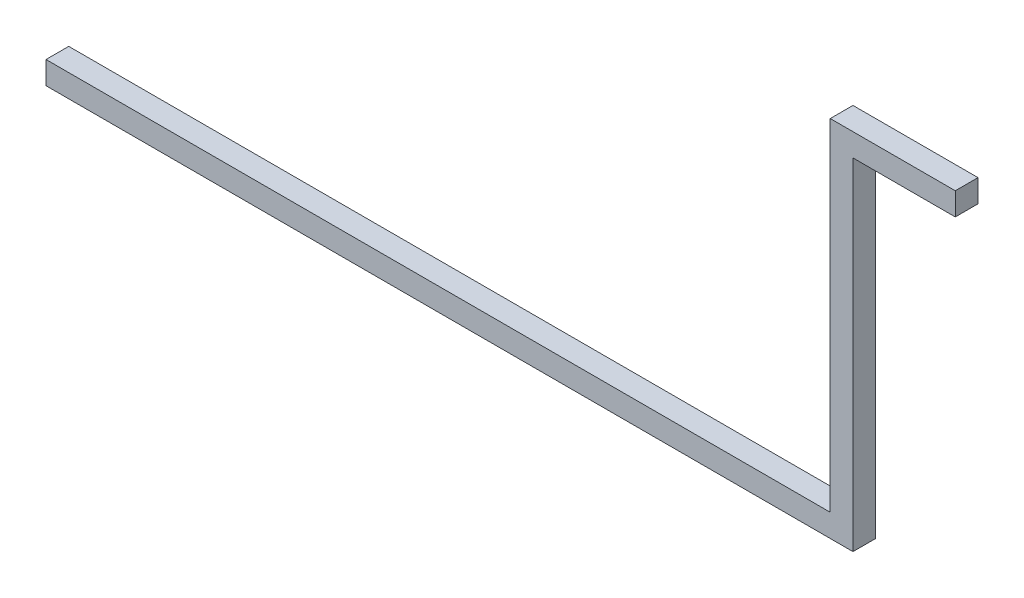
from build123d import *

# Parameters (mm, degrees)
EXTRUDE_THIN1_DEPTH = 10


with BuildPart() as part:
    # Sketch1 → Extrude-Thin1 (new body)
    with BuildSketch(Plane.XY):
        Polygon((-400, -5), (-45, -5), (-45, 145), (0, 145), (0, 155), (-55, 155), (-55, 5), (-400, 5), align=None)
    extrude(amount=EXTRUDE_THIN1_DEPTH)


solid = part.part
